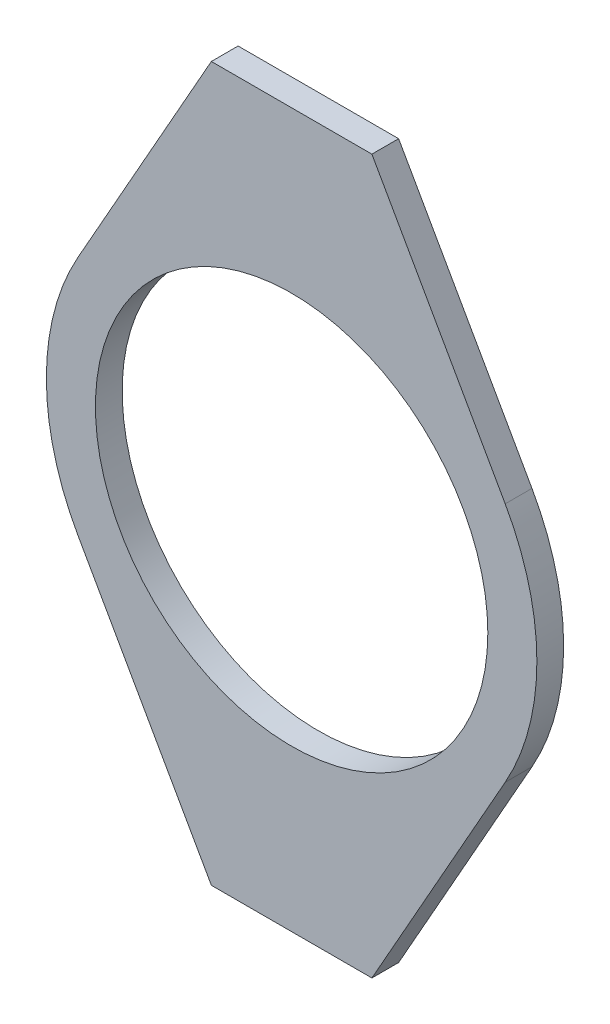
ISO-10303-21;
HEADER;
FILE_DESCRIPTION(('STEP AP214'),'2;1');
FILE_NAME('part.step','',(''),(''),'','','');
FILE_SCHEMA(('AUTOMOTIVE_DESIGN { 1 0 10303 214 1 1 1 1 }'));
ENDSEC;
DATA;
#1=APPLICATION_CONTEXT('core data for automotive mechanical design processes');
#2=APPLICATION_PROTOCOL_DEFINITION('international standard','automotive_design',2000,#1);
#3=PRODUCT_CONTEXT('',#1,'mechanical');
#4=PRODUCT('Part','Part','',(#3));
#5=PRODUCT_RELATED_PRODUCT_CATEGORY('part','',(#4));
#6=PRODUCT_DEFINITION_FORMATION('','',#4);
#7=PRODUCT_DEFINITION_CONTEXT('part definition',#1,'design');
#8=PRODUCT_DEFINITION('design','',#6,#7);
#9=PRODUCT_DEFINITION_SHAPE('','',#8);
#10=(LENGTH_UNIT() NAMED_UNIT(*) SI_UNIT(.MILLI.,.METRE.));
#11=(NAMED_UNIT(*) PLANE_ANGLE_UNIT() SI_UNIT($,.RADIAN.));
#12=(NAMED_UNIT(*) SI_UNIT($,.STERADIAN.) SOLID_ANGLE_UNIT());
#13=UNCERTAINTY_MEASURE_WITH_UNIT(LENGTH_MEASURE(1.E-05),#10,'distance_accuracy_value','');
#14=(GEOMETRIC_REPRESENTATION_CONTEXT(3) GLOBAL_UNCERTAINTY_ASSIGNED_CONTEXT((#13)) GLOBAL_UNIT_ASSIGNED_CONTEXT((#10,
#11,#12)) REPRESENTATION_CONTEXT('',''));
#15=CARTESIAN_POINT('',(0.,0.,0.));
#16=DIRECTION('',(0.,0.,1.));
#17=DIRECTION('',(1.,0.,0.));
#18=AXIS2_PLACEMENT_3D('',#15,#16,#17);
#19=CARTESIAN_POINT('',(0.,0.,1.5));
#20=DIRECTION('',(0.,0.,1.));
#21=DIRECTION('',(1.,0.,0.));
#22=AXIS2_PLACEMENT_3D('',#19,#20,#21);
#23=PLANE('',#22);
#24=CARTESIAN_POINT('',(0.,0.,1.5));
#25=DIRECTION('',(0.,0.,1.));
#26=DIRECTION('',(1.,0.,0.));
#27=AXIS2_PLACEMENT_3D('',#24,#25,#26);
#28=CIRCLE('',#27,11.);
#29=CARTESIAN_POINT('',(11.,0.,1.5));
#30=VERTEX_POINT('',#29);
#31=EDGE_CURVE('E142',#30,#30,#28,.F.);
#32=ORIENTED_EDGE('',*,*,#31,.T.);
#33=EDGE_LOOP('',(#32));
#34=FACE_BOUND('',#33,.T.);
#35=DIRECTION('',(1.,0.,0.));
#36=VECTOR('',#35,1.);
#37=CARTESIAN_POINT('',(4.5,20.,1.5));
#38=LINE('',#37,#36);
#39=CARTESIAN_POINT('',(-4.5,20.,1.5));
#40=VERTEX_POINT('',#39);
#41=CARTESIAN_POINT('',(4.50000000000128,20.0000000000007,1.5));
#42=VERTEX_POINT('',#41);
#43=EDGE_CURVE('E94',#40,#42,#38,.T.);
#44=ORIENTED_EDGE('',*,*,#43,.F.);
#45=DIRECTION('',(-0.491560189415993,-0.870843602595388,0.));
#46=VECTOR('',#45,1.);
#47=CARTESIAN_POINT('',(-4.5,20.,1.5));
#48=LINE('',#47,#46);
#49=CARTESIAN_POINT('',(-11.9740995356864,6.75895260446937,1.5));
#50=VERTEX_POINT('',#49);
#51=EDGE_CURVE('E91',#50,#40,#48,.F.);
#52=ORIENTED_EDGE('',*,*,#51,.F.);
#53=CARTESIAN_POINT('',(0.,0.,1.5));
#54=DIRECTION('',(0.,0.,1.));
#55=DIRECTION('',(1.,0.,0.));
#56=AXIS2_PLACEMENT_3D('',#53,#54,#55);
#57=CIRCLE('',#56,13.75);
#58=CARTESIAN_POINT('',(-11.9740995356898,-6.75895260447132,1.5));
#59=VERTEX_POINT('',#58);
#60=EDGE_CURVE('E19',#59,#50,#57,.F.);
#61=ORIENTED_EDGE('',*,*,#60,.F.);
#62=DIRECTION('',(0.491560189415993,-0.870843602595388,0.));
#63=VECTOR('',#62,1.);
#64=CARTESIAN_POINT('',(-11.97409953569,-6.758952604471,1.5));
#65=LINE('',#64,#63);
#66=CARTESIAN_POINT('',(-4.50000000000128,-20.0000000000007,1.5));
#67=VERTEX_POINT('',#66);
#68=EDGE_CURVE('E78',#67,#59,#65,.F.);
#69=ORIENTED_EDGE('',*,*,#68,.F.);
#70=DIRECTION('',(1.,0.,0.));
#71=VECTOR('',#70,1.);
#72=CARTESIAN_POINT('',(-4.5,-20.,1.5));
#73=LINE('',#72,#71);
#74=CARTESIAN_POINT('',(4.5,-20.,1.5));
#75=VERTEX_POINT('',#74);
#76=EDGE_CURVE('E128',#75,#67,#73,.F.);
#77=ORIENTED_EDGE('',*,*,#76,.F.);
#78=DIRECTION('',(0.491560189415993,0.870843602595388,0.));
#79=VECTOR('',#78,1.);
#80=CARTESIAN_POINT('',(4.5,-20.,1.5));
#81=LINE('',#80,#79);
#82=CARTESIAN_POINT('',(11.9740995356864,-6.75895260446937,1.5));
#83=VERTEX_POINT('',#82);
#84=EDGE_CURVE('E122',#83,#75,#81,.F.);
#85=ORIENTED_EDGE('',*,*,#84,.F.);
#86=CARTESIAN_POINT('',(0.,0.,1.5));
#87=DIRECTION('',(0.,0.,1.));
#88=DIRECTION('',(1.,0.,0.));
#89=AXIS2_PLACEMENT_3D('',#86,#87,#88);
#90=CIRCLE('',#89,13.75);
#91=CARTESIAN_POINT('',(11.9740995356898,6.75895260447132,1.5));
#92=VERTEX_POINT('',#91);
#93=EDGE_CURVE('E144',#92,#83,#90,.F.);
#94=ORIENTED_EDGE('',*,*,#93,.F.);
#95=DIRECTION('',(-0.491560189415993,0.870843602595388,0.));
#96=VECTOR('',#95,1.);
#97=CARTESIAN_POINT('',(11.97409953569,6.758952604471,1.5));
#98=LINE('',#97,#96);
#99=EDGE_CURVE('E112',#42,#92,#98,.F.);
#100=ORIENTED_EDGE('',*,*,#99,.F.);
#101=EDGE_LOOP('',(#44,#52,#61,#69,#77,#85,#94,#100));
#102=FACE_BOUND('',#101,.T.);
#103=ADVANCED_FACE('F16',(#34,#102),#23,.T.);
#104=CARTESIAN_POINT('',(-4.5,20.,0.));
#105=DIRECTION('',(-0.870843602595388,0.491560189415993,0.));
#106=DIRECTION('',(-0.491560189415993,-0.870843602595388,0.));
#107=AXIS2_PLACEMENT_3D('',#104,#105,#106);
#108=PLANE('',#107);
#109=DIRECTION('',(0.,0.,1.));
#110=VECTOR('',#109,1.);
#111=CARTESIAN_POINT('',(-4.5,20.,0.));
#112=LINE('',#111,#110);
#113=CARTESIAN_POINT('',(-4.5,20.,0.));
#114=VERTEX_POINT('',#113);
#115=EDGE_CURVE('E107',#114,#40,#112,.T.);
#116=ORIENTED_EDGE('',*,*,#115,.F.);
#117=DIRECTION('',(-0.491560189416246,-0.870843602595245,0.));
#118=VECTOR('',#117,1.);
#119=CARTESIAN_POINT('',(-4.5,20.,0.));
#120=LINE('',#119,#118);
#121=CARTESIAN_POINT('',(-11.9740995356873,6.75895260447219,0.));
#122=VERTEX_POINT('',#121);
#123=EDGE_CURVE('E101',#114,#122,#120,.T.);
#124=ORIENTED_EDGE('',*,*,#123,.T.);
#125=DIRECTION('',(0.,0.,1.));
#126=VECTOR('',#125,1.);
#127=CARTESIAN_POINT('',(-11.9740995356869,6.75895260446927,0.));
#128=LINE('',#127,#126);
#129=EDGE_CURVE('E87',#50,#122,#128,.F.);
#130=ORIENTED_EDGE('',*,*,#129,.F.);
#131=ORIENTED_EDGE('',*,*,#51,.T.);
#132=EDGE_LOOP('',(#116,#124,#130,#131));
#133=FACE_BOUND('',#132,.T.);
#134=ADVANCED_FACE('F100',(#133),#108,.T.);
#135=CARTESIAN_POINT('',(0.,0.,0.));
#136=DIRECTION('',(0.,0.,1.));
#137=DIRECTION('',(1.,0.,0.));
#138=AXIS2_PLACEMENT_3D('',#135,#136,#137);
#139=CYLINDRICAL_SURFACE('',#138,13.75);
#140=ORIENTED_EDGE('',*,*,#129,.T.);
#141=CARTESIAN_POINT('',(0.,0.,0.));
#142=DIRECTION('',(0.,0.,1.));
#143=DIRECTION('',(1.,0.,0.));
#144=AXIS2_PLACEMENT_3D('',#141,#142,#143);
#145=CIRCLE('',#144,13.75);
#146=CARTESIAN_POINT('',(-11.9740995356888,-6.75895260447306,0.));
#147=VERTEX_POINT('',#146);
#148=EDGE_CURVE('E139',#122,#147,#145,.T.);
#149=ORIENTED_EDGE('',*,*,#148,.T.);
#150=DIRECTION('',(0.,0.,1.));
#151=VECTOR('',#150,1.);
#152=CARTESIAN_POINT('',(-11.97409953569,-6.758952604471,0.));
#153=LINE('',#152,#151);
#154=EDGE_CURVE('E89',#59,#147,#153,.F.);
#155=ORIENTED_EDGE('',*,*,#154,.F.);
#156=ORIENTED_EDGE('',*,*,#60,.T.);
#157=EDGE_LOOP('',(#140,#149,#155,#156));
#158=FACE_BOUND('',#157,.T.);
#159=ADVANCED_FACE('F84',(#158),#139,.T.);
#160=CARTESIAN_POINT('',(-11.97409953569,-6.758952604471,0.));
#161=DIRECTION('',(-0.870843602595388,-0.491560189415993,0.));
#162=DIRECTION('',(0.491560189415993,-0.870843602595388,0.));
#163=AXIS2_PLACEMENT_3D('',#160,#161,#162);
#164=PLANE('',#163);
#165=ORIENTED_EDGE('',*,*,#154,.T.);
#166=DIRECTION('',(0.491560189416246,-0.870843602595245,0.));
#167=VECTOR('',#166,1.);
#168=CARTESIAN_POINT('',(-11.97409953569,-6.758952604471,0.));
#169=LINE('',#168,#167);
#170=CARTESIAN_POINT('',(-4.5,-20.,0.));
#171=VERTEX_POINT('',#170);
#172=EDGE_CURVE('E141',#147,#171,#169,.T.);
#173=ORIENTED_EDGE('',*,*,#172,.T.);
#174=DIRECTION('',(0.,0.,-1.));
#175=VECTOR('',#174,1.);
#176=CARTESIAN_POINT('',(-4.5,-20.,0.));
#177=LINE('',#176,#175);
#178=EDGE_CURVE('E125',#67,#171,#177,.T.);
#179=ORIENTED_EDGE('',*,*,#178,.F.);
#180=ORIENTED_EDGE('',*,*,#68,.T.);
#181=EDGE_LOOP('',(#165,#173,#179,#180));
#182=FACE_BOUND('',#181,.T.);
#183=ADVANCED_FACE('F175',(#182),#164,.T.);
#184=CARTESIAN_POINT('',(-4.5,-20.,0.));
#185=DIRECTION('',(0.,-1.,0.));
#186=DIRECTION('',(0.,0.,-1.));
#187=AXIS2_PLACEMENT_3D('',#184,#185,#186);
#188=PLANE('',#187);
#189=ORIENTED_EDGE('',*,*,#178,.T.);
#190=DIRECTION('',(1.,0.,0.));
#191=VECTOR('',#190,1.);
#192=CARTESIAN_POINT('',(0.,-20.,0.));
#193=LINE('',#192,#191);
#194=CARTESIAN_POINT('',(4.5,-20.,0.));
#195=VERTEX_POINT('',#194);
#196=EDGE_CURVE('E159',#171,#195,#193,.T.);
#197=ORIENTED_EDGE('',*,*,#196,.T.);
#198=DIRECTION('',(0.,0.,1.));
#199=VECTOR('',#198,1.);
#200=CARTESIAN_POINT('',(4.5,-20.,0.));
#201=LINE('',#200,#199);
#202=EDGE_CURVE('E124',#75,#195,#201,.F.);
#203=ORIENTED_EDGE('',*,*,#202,.F.);
#204=ORIENTED_EDGE('',*,*,#76,.T.);
#205=EDGE_LOOP('',(#189,#197,#203,#204));
#206=FACE_BOUND('',#205,.T.);
#207=ADVANCED_FACE('F167',(#206),#188,.T.);
#208=CARTESIAN_POINT('',(4.5,-20.,0.));
#209=DIRECTION('',(0.870843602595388,-0.491560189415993,0.));
#210=DIRECTION('',(0.491560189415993,0.870843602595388,0.));
#211=AXIS2_PLACEMENT_3D('',#208,#209,#210);
#212=PLANE('',#211);
#213=ORIENTED_EDGE('',*,*,#202,.T.);
#214=DIRECTION('',(0.491560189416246,0.870843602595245,0.));
#215=VECTOR('',#214,1.);
#216=CARTESIAN_POINT('',(4.5,-20.,0.));
#217=LINE('',#216,#215);
#218=CARTESIAN_POINT('',(11.9740995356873,-6.75895260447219,0.));
#219=VERTEX_POINT('',#218);
#220=EDGE_CURVE('E138',#195,#219,#217,.T.);
#221=ORIENTED_EDGE('',*,*,#220,.T.);
#222=DIRECTION('',(0.,0.,1.));
#223=VECTOR('',#222,1.);
#224=CARTESIAN_POINT('',(11.9740995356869,-6.75895260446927,0.));
#225=LINE('',#224,#223);
#226=EDGE_CURVE('E114',#83,#219,#225,.F.);
#227=ORIENTED_EDGE('',*,*,#226,.F.);
#228=ORIENTED_EDGE('',*,*,#84,.T.);
#229=EDGE_LOOP('',(#213,#221,#227,#228));
#230=FACE_BOUND('',#229,.T.);
#231=ADVANCED_FACE('F197',(#230),#212,.T.);
#232=CARTESIAN_POINT('',(0.,0.,0.));
#233=DIRECTION('',(0.,0.,1.));
#234=DIRECTION('',(1.,0.,0.));
#235=AXIS2_PLACEMENT_3D('',#232,#233,#234);
#236=CYLINDRICAL_SURFACE('',#235,13.75);
#237=ORIENTED_EDGE('',*,*,#226,.T.);
#238=CARTESIAN_POINT('',(0.,0.,0.));
#239=DIRECTION('',(0.,0.,1.));
#240=DIRECTION('',(1.,0.,0.));
#241=AXIS2_PLACEMENT_3D('',#238,#239,#240);
#242=CIRCLE('',#241,13.75);
#243=CARTESIAN_POINT('',(11.9740995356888,6.75895260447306,0.));
#244=VERTEX_POINT('',#243);
#245=EDGE_CURVE('E134',#219,#244,#242,.T.);
#246=ORIENTED_EDGE('',*,*,#245,.T.);
#247=DIRECTION('',(0.,0.,1.));
#248=VECTOR('',#247,1.);
#249=CARTESIAN_POINT('',(11.97409953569,6.758952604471,0.));
#250=LINE('',#249,#248);
#251=EDGE_CURVE('E109',#92,#244,#250,.F.);
#252=ORIENTED_EDGE('',*,*,#251,.F.);
#253=ORIENTED_EDGE('',*,*,#93,.T.);
#254=EDGE_LOOP('',(#237,#246,#252,#253));
#255=FACE_BOUND('',#254,.T.);
#256=ADVANCED_FACE('F198',(#255),#236,.T.);
#257=CARTESIAN_POINT('',(11.97409953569,6.758952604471,0.));
#258=DIRECTION('',(0.870843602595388,0.491560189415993,0.));
#259=DIRECTION('',(-0.491560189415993,0.870843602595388,0.));
#260=AXIS2_PLACEMENT_3D('',#257,#258,#259);
#261=PLANE('',#260);
#262=ORIENTED_EDGE('',*,*,#251,.T.);
#263=DIRECTION('',(-0.491560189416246,0.870843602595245,0.));
#264=VECTOR('',#263,1.);
#265=CARTESIAN_POINT('',(11.97409953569,6.758952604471,0.));
#266=LINE('',#265,#264);
#267=CARTESIAN_POINT('',(4.5,20.,0.));
#268=VERTEX_POINT('',#267);
#269=EDGE_CURVE('E137',#244,#268,#266,.T.);
#270=ORIENTED_EDGE('',*,*,#269,.T.);
#271=DIRECTION('',(0.,0.,1.));
#272=VECTOR('',#271,1.);
#273=CARTESIAN_POINT('',(4.5,20.,0.));
#274=LINE('',#273,#272);
#275=EDGE_CURVE('E34',#42,#268,#274,.F.);
#276=ORIENTED_EDGE('',*,*,#275,.F.);
#277=ORIENTED_EDGE('',*,*,#99,.T.);
#278=EDGE_LOOP('',(#262,#270,#276,#277));
#279=FACE_BOUND('',#278,.T.);
#280=ADVANCED_FACE('F200',(#279),#261,.T.);
#281=CARTESIAN_POINT('',(4.5,20.,0.));
#282=DIRECTION('',(0.,1.,0.));
#283=DIRECTION('',(0.,0.,1.));
#284=AXIS2_PLACEMENT_3D('',#281,#282,#283);
#285=PLANE('',#284);
#286=ORIENTED_EDGE('',*,*,#275,.T.);
#287=DIRECTION('',(1.,0.,0.));
#288=VECTOR('',#287,1.);
#289=CARTESIAN_POINT('',(0.,20.,0.));
#290=LINE('',#289,#288);
#291=EDGE_CURVE('E25',#268,#114,#290,.F.);
#292=ORIENTED_EDGE('',*,*,#291,.T.);
#293=ORIENTED_EDGE('',*,*,#115,.T.);
#294=ORIENTED_EDGE('',*,*,#43,.T.);
#295=EDGE_LOOP('',(#286,#292,#293,#294));
#296=FACE_BOUND('',#295,.T.);
#297=ADVANCED_FACE('F199',(#296),#285,.T.);
#298=CARTESIAN_POINT('',(0.,0.,0.));
#299=DIRECTION('',(0.,0.,1.));
#300=DIRECTION('',(1.,0.,0.));
#301=AXIS2_PLACEMENT_3D('',#298,#299,#300);
#302=CYLINDRICAL_SURFACE('',#301,11.);
#303=ORIENTED_EDGE('',*,*,#31,.F.);
#304=EDGE_LOOP('',(#303));
#305=FACE_BOUND('',#304,.T.);
#306=CARTESIAN_POINT('',(0.,0.,0.));
#307=DIRECTION('',(0.,0.,1.));
#308=DIRECTION('',(1.,0.,0.));
#309=AXIS2_PLACEMENT_3D('',#306,#307,#308);
#310=CIRCLE('',#309,11.);
#311=CARTESIAN_POINT('',(11.,0.,0.));
#312=VERTEX_POINT('',#311);
#313=EDGE_CURVE('E11',#312,#312,#310,.F.);
#314=ORIENTED_EDGE('',*,*,#313,.T.);
#315=EDGE_LOOP('',(#314));
#316=FACE_BOUND('',#315,.T.);
#317=ADVANCED_FACE('F209',(#305,#316),#302,.F.);
#318=CARTESIAN_POINT('',(0.,0.,0.));
#319=DIRECTION('',(0.,0.,1.));
#320=DIRECTION('',(1.,0.,0.));
#321=AXIS2_PLACEMENT_3D('',#318,#319,#320);
#322=PLANE('',#321);
#323=ORIENTED_EDGE('',*,*,#313,.F.);
#324=EDGE_LOOP('',(#323));
#325=FACE_BOUND('',#324,.T.);
#326=ORIENTED_EDGE('',*,*,#269,.F.);
#327=ORIENTED_EDGE('',*,*,#245,.F.);
#328=ORIENTED_EDGE('',*,*,#220,.F.);
#329=ORIENTED_EDGE('',*,*,#196,.F.);
#330=ORIENTED_EDGE('',*,*,#172,.F.);
#331=ORIENTED_EDGE('',*,*,#148,.F.);
#332=ORIENTED_EDGE('',*,*,#123,.F.);
#333=ORIENTED_EDGE('',*,*,#291,.F.);
#334=EDGE_LOOP('',(#326,#327,#328,#329,#330,#331,#332,#333));
#335=FACE_BOUND('',#334,.T.);
#336=ADVANCED_FACE('F173',(#325,#335),#322,.F.);
#337=CLOSED_SHELL('',(#103,#134,#159,#183,#207,#231,#256,#280,#297,#317,#336));
#338=MANIFOLD_SOLID_BREP('B1',#337);
#339=ADVANCED_BREP_SHAPE_REPRESENTATION('',(#18,#338),#14);
#340=SHAPE_DEFINITION_REPRESENTATION(#9,#339);
ENDSEC;
END-ISO-10303-21;
